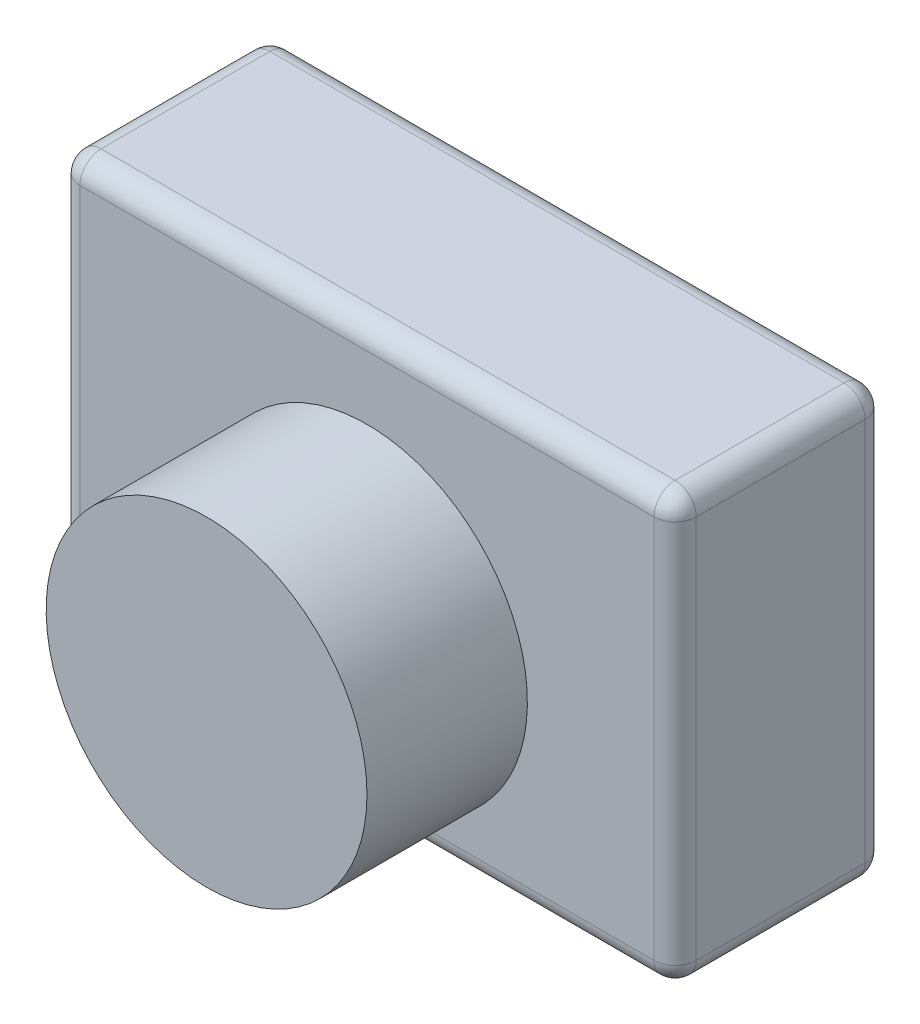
from build123d import *

# Parameters (mm, degrees)
SKETCH1_W                 = 146
SKETCH1_H                 = 101
BOSS_EXTRUDE1_DEPTH       = 50
FILLET1_R                 = 5
SKETCH2_R                 = 38
BOSS_EXTRUDE2_DEPTH       = 38
F_6_CLEARANCE_HOLE1_D     = 3.7973
F_6_CLEARANCE_HOLE1_DEPTH = 5
F_6_CLEARANCE_HOLE1_TIP   = 1.140824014


with BuildPart() as part:
    # Sketch1 → Boss-Extrude1 (new body)
    with BuildSketch(Plane.XY):
        with Locations((52.604946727, -32.262115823)):
            Rectangle(SKETCH1_W, SKETCH1_H)
    extrude(amount=BOSS_EXTRUDE1_DEPTH)

    # Fillet1
    fillet1_edges = [part.edges().sort_by_distance(p)[0] for p in [
        (125.604946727, -32.262115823, 50),
        (52.604946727, 18.237884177, 50),
        (-20.395053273, -32.262115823, 50),
        (52.604946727, 18.237884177, 0),
        (125.604946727, -32.262115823, 0),
        (52.604946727, -82.762115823, 0),
        (-20.395053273, -32.262115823, 0),
        (52.604946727, -82.762115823, 50),
        (-20.395053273, 18.237884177, 25),
        (125.604946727, 18.237884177, 25),
        (125.604946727, -82.762115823, 25),
        (-20.395053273, -82.762115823, 25),
    ]]
    fillet(fillet1_edges, radius=FILLET1_R)

    # Sketch2 → Boss-Extrude2 (add)
    with BuildSketch(Plane.XY.offset(50)):
        with Locations(Location((52.604946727, -39.762115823, 0), (0, 0, 270))):
            Circle(SKETCH2_R)
    extrude(amount=BOSS_EXTRUDE2_DEPTH)

    # 6 Clearance Hole1
    with Locations(Plane.XZ.offset(82.762115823)):
        with Locations((24, 25), (74, 25)):
            Hole(F_6_CLEARANCE_HOLE1_D / 2, depth=F_6_CLEARANCE_HOLE1_DEPTH)
            with Locations((0, 0, -(F_6_CLEARANCE_HOLE1_DEPTH + F_6_CLEARANCE_HOLE1_TIP / 2))):  # 118° drill point
                Cone(0, F_6_CLEARANCE_HOLE1_D / 2, F_6_CLEARANCE_HOLE1_TIP, mode=Mode.SUBTRACT)


solid = part.part
